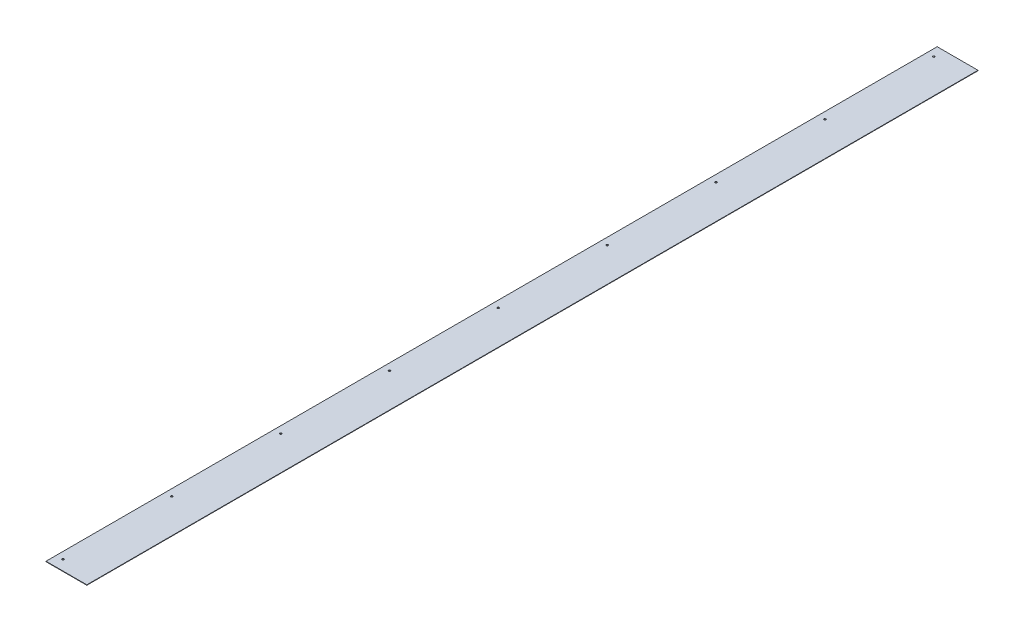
ISO-10303-21;
HEADER;
FILE_DESCRIPTION(('STEP AP214'),'2;1');
FILE_NAME('part.step','',(''),(''),'','','');
FILE_SCHEMA(('AUTOMOTIVE_DESIGN { 1 0 10303 214 1 1 1 1 }'));
ENDSEC;
DATA;
#1=APPLICATION_CONTEXT('core data for automotive mechanical design processes');
#2=APPLICATION_PROTOCOL_DEFINITION('international standard','automotive_design',2000,#1);
#3=PRODUCT_CONTEXT('',#1,'mechanical');
#4=PRODUCT('Part','Part','',(#3));
#5=PRODUCT_RELATED_PRODUCT_CATEGORY('part','',(#4));
#6=PRODUCT_DEFINITION_FORMATION('','',#4);
#7=PRODUCT_DEFINITION_CONTEXT('part definition',#1,'design');
#8=PRODUCT_DEFINITION('design','',#6,#7);
#9=PRODUCT_DEFINITION_SHAPE('','',#8);
#10=(LENGTH_UNIT() NAMED_UNIT(*) SI_UNIT(.MILLI.,.METRE.));
#11=(NAMED_UNIT(*) PLANE_ANGLE_UNIT() SI_UNIT($,.RADIAN.));
#12=(NAMED_UNIT(*) SI_UNIT($,.STERADIAN.) SOLID_ANGLE_UNIT());
#13=UNCERTAINTY_MEASURE_WITH_UNIT(LENGTH_MEASURE(1.E-05),#10,'distance_accuracy_value','');
#14=(GEOMETRIC_REPRESENTATION_CONTEXT(3) GLOBAL_UNCERTAINTY_ASSIGNED_CONTEXT((#13)) GLOBAL_UNIT_ASSIGNED_CONTEXT((#10,
#11,#12)) REPRESENTATION_CONTEXT('',''));
#15=CARTESIAN_POINT('',(0.,0.,0.));
#16=DIRECTION('',(0.,0.,1.));
#17=DIRECTION('',(1.,0.,0.));
#18=AXIS2_PLACEMENT_3D('',#15,#16,#17);
#19=CARTESIAN_POINT('',(-38.1,-0.396875,-831.85));
#20=DIRECTION('',(0.,-1.,0.));
#21=DIRECTION('',(0.,0.,-1.));
#22=AXIS2_PLACEMENT_3D('',#19,#20,#21);
#23=PLANE('',#22);
#24=DIRECTION('',(0.,0.,-1.));
#25=VECTOR('',#24,1.);
#26=CARTESIAN_POINT('',(38.1,-0.396875,831.85));
#27=LINE('',#26,#25);
#28=CARTESIAN_POINT('',(38.1,-0.396875,831.85));
#29=VERTEX_POINT('',#28);
#30=CARTESIAN_POINT('',(38.1,-0.396875,-831.85));
#31=VERTEX_POINT('',#30);
#32=EDGE_CURVE('E379',#29,#31,#27,.T.);
#33=ORIENTED_EDGE('',*,*,#32,.F.);
#34=DIRECTION('',(1.,0.,0.));
#35=VECTOR('',#34,1.);
#36=CARTESIAN_POINT('',(-38.1,-0.396875,831.85));
#37=LINE('',#36,#35);
#38=CARTESIAN_POINT('',(-38.1,-0.396875,831.85));
#39=VERTEX_POINT('',#38);
#40=EDGE_CURVE('E384',#39,#29,#37,.T.);
#41=ORIENTED_EDGE('',*,*,#40,.F.);
#42=DIRECTION('',(0.,0.,1.));
#43=VECTOR('',#42,1.);
#44=CARTESIAN_POINT('',(-38.1,-0.396875,-831.85));
#45=LINE('',#44,#43);
#46=CARTESIAN_POINT('',(-38.1,-0.396875,-831.85));
#47=VERTEX_POINT('',#46);
#48=EDGE_CURVE('E388',#47,#39,#45,.T.);
#49=ORIENTED_EDGE('',*,*,#48,.F.);
#50=DIRECTION('',(-1.,0.,0.));
#51=VECTOR('',#50,1.);
#52=CARTESIAN_POINT('',(38.1,-0.396875,-831.85));
#53=LINE('',#52,#51);
#54=EDGE_CURVE('E393',#31,#47,#53,.T.);
#55=ORIENTED_EDGE('',*,*,#54,.F.);
#56=EDGE_LOOP('',(#33,#41,#49,#55));
#57=FACE_BOUND('',#56,.T.);
#58=CARTESIAN_POINT('',(-25.4,-0.396875,812.8));
#59=DIRECTION('',(0.,-1.,0.));
#60=DIRECTION('',(0.,0.,-1.));
#61=AXIS2_PLACEMENT_3D('',#58,#59,#60);
#62=CIRCLE('',#61,1.778);
#63=CARTESIAN_POINT('',(-27.178,-0.396875,812.8));
#64=VERTEX_POINT('',#63);
#65=CARTESIAN_POINT('',(-23.622,-0.396875,812.8));
#66=VERTEX_POINT('',#65);
#67=EDGE_CURVE('E271',#64,#66,#62,.F.);
#68=ORIENTED_EDGE('',*,*,#67,.T.);
#69=CARTESIAN_POINT('',(-25.4,-0.396875,812.8));
#70=DIRECTION('',(0.,-1.,0.));
#71=DIRECTION('',(0.,0.,-1.));
#72=AXIS2_PLACEMENT_3D('',#69,#70,#71);
#73=CIRCLE('',#72,1.778);
#74=EDGE_CURVE('E267',#66,#64,#73,.F.);
#75=ORIENTED_EDGE('',*,*,#74,.T.);
#76=EDGE_LOOP('',(#68,#75));
#77=FACE_BOUND('',#76,.T.);
#78=CARTESIAN_POINT('',(-25.4,-0.396875,609.6));
#79=DIRECTION('',(0.,-1.,0.));
#80=DIRECTION('',(0.,0.,-1.));
#81=AXIS2_PLACEMENT_3D('',#78,#79,#80);
#82=CIRCLE('',#81,1.778);
#83=CARTESIAN_POINT('',(-27.178,-0.396875,609.6));
#84=VERTEX_POINT('',#83);
#85=CARTESIAN_POINT('',(-23.622,-0.396875,609.6));
#86=VERTEX_POINT('',#85);
#87=EDGE_CURVE('E279',#84,#86,#82,.F.);
#88=ORIENTED_EDGE('',*,*,#87,.T.);
#89=CARTESIAN_POINT('',(-25.4,-0.396875,609.6));
#90=DIRECTION('',(0.,-1.,0.));
#91=DIRECTION('',(0.,0.,-1.));
#92=AXIS2_PLACEMENT_3D('',#89,#90,#91);
#93=CIRCLE('',#92,1.778);
#94=EDGE_CURVE('E275',#86,#84,#93,.F.);
#95=ORIENTED_EDGE('',*,*,#94,.T.);
#96=EDGE_LOOP('',(#88,#95));
#97=FACE_BOUND('',#96,.T.);
#98=CARTESIAN_POINT('',(-25.4,-0.396875,406.4));
#99=DIRECTION('',(0.,-1.,0.));
#100=DIRECTION('',(0.,0.,-1.));
#101=AXIS2_PLACEMENT_3D('',#98,#99,#100);
#102=CIRCLE('',#101,1.778);
#103=CARTESIAN_POINT('',(-27.178,-0.396875,406.4));
#104=VERTEX_POINT('',#103);
#105=CARTESIAN_POINT('',(-23.622,-0.396875,406.4));
#106=VERTEX_POINT('',#105);
#107=EDGE_CURVE('E288',#104,#106,#102,.F.);
#108=ORIENTED_EDGE('',*,*,#107,.T.);
#109=CARTESIAN_POINT('',(-25.4,-0.396875,406.4));
#110=DIRECTION('',(0.,-1.,0.));
#111=DIRECTION('',(0.,0.,-1.));
#112=AXIS2_PLACEMENT_3D('',#109,#110,#111);
#113=CIRCLE('',#112,1.778);
#114=EDGE_CURVE('E283',#106,#104,#113,.F.);
#115=ORIENTED_EDGE('',*,*,#114,.T.);
#116=EDGE_LOOP('',(#108,#115));
#117=FACE_BOUND('',#116,.T.);
#118=CARTESIAN_POINT('',(-25.4,-0.396875,203.2));
#119=DIRECTION('',(0.,-1.,0.));
#120=DIRECTION('',(0.,0.,-1.));
#121=AXIS2_PLACEMENT_3D('',#118,#119,#120);
#122=CIRCLE('',#121,1.778);
#123=CARTESIAN_POINT('',(-27.178,-0.396875,203.2));
#124=VERTEX_POINT('',#123);
#125=CARTESIAN_POINT('',(-23.622,-0.396875,203.2));
#126=VERTEX_POINT('',#125);
#127=EDGE_CURVE('E298',#124,#126,#122,.F.);
#128=ORIENTED_EDGE('',*,*,#127,.T.);
#129=CARTESIAN_POINT('',(-25.4,-0.396875,203.2));
#130=DIRECTION('',(0.,-1.,0.));
#131=DIRECTION('',(0.,0.,-1.));
#132=AXIS2_PLACEMENT_3D('',#129,#130,#131);
#133=CIRCLE('',#132,1.778);
#134=EDGE_CURVE('E293',#126,#124,#133,.F.);
#135=ORIENTED_EDGE('',*,*,#134,.T.);
#136=EDGE_LOOP('',(#128,#135));
#137=FACE_BOUND('',#136,.T.);
#138=CARTESIAN_POINT('',(-25.4,-0.396875,0.));
#139=DIRECTION('',(0.,-1.,0.));
#140=DIRECTION('',(0.,0.,-1.));
#141=AXIS2_PLACEMENT_3D('',#138,#139,#140);
#142=CIRCLE('',#141,1.778);
#143=CARTESIAN_POINT('',(-27.178,-0.396875,0.));
#144=VERTEX_POINT('',#143);
#145=CARTESIAN_POINT('',(-23.622,-0.396875,0.));
#146=VERTEX_POINT('',#145);
#147=EDGE_CURVE('E308',#144,#146,#142,.F.);
#148=ORIENTED_EDGE('',*,*,#147,.T.);
#149=CARTESIAN_POINT('',(-25.4,-0.396875,0.));
#150=DIRECTION('',(0.,-1.,0.));
#151=DIRECTION('',(0.,0.,-1.));
#152=AXIS2_PLACEMENT_3D('',#149,#150,#151);
#153=CIRCLE('',#152,1.778);
#154=EDGE_CURVE('E303',#146,#144,#153,.F.);
#155=ORIENTED_EDGE('',*,*,#154,.T.);
#156=EDGE_LOOP('',(#148,#155));
#157=FACE_BOUND('',#156,.T.);
#158=CARTESIAN_POINT('',(-25.4,-0.396875,-203.2));
#159=DIRECTION('',(0.,-1.,0.));
#160=DIRECTION('',(0.,0.,-1.));
#161=AXIS2_PLACEMENT_3D('',#158,#159,#160);
#162=CIRCLE('',#161,1.778);
#163=CARTESIAN_POINT('',(-27.178,-0.396875,-203.2));
#164=VERTEX_POINT('',#163);
#165=CARTESIAN_POINT('',(-23.622,-0.396875,-203.2));
#166=VERTEX_POINT('',#165);
#167=EDGE_CURVE('E318',#164,#166,#162,.F.);
#168=ORIENTED_EDGE('',*,*,#167,.T.);
#169=CARTESIAN_POINT('',(-25.4,-0.396875,-203.2));
#170=DIRECTION('',(0.,-1.,0.));
#171=DIRECTION('',(0.,0.,-1.));
#172=AXIS2_PLACEMENT_3D('',#169,#170,#171);
#173=CIRCLE('',#172,1.778);
#174=EDGE_CURVE('E313',#166,#164,#173,.F.);
#175=ORIENTED_EDGE('',*,*,#174,.T.);
#176=EDGE_LOOP('',(#168,#175));
#177=FACE_BOUND('',#176,.T.);
#178=CARTESIAN_POINT('',(-25.4,-0.396875,-406.4));
#179=DIRECTION('',(0.,-1.,0.));
#180=DIRECTION('',(0.,0.,-1.));
#181=AXIS2_PLACEMENT_3D('',#178,#179,#180);
#182=CIRCLE('',#181,1.778);
#183=CARTESIAN_POINT('',(-27.178,-0.396875,-406.4));
#184=VERTEX_POINT('',#183);
#185=CARTESIAN_POINT('',(-23.622,-0.396875,-406.4));
#186=VERTEX_POINT('',#185);
#187=EDGE_CURVE('E328',#184,#186,#182,.F.);
#188=ORIENTED_EDGE('',*,*,#187,.T.);
#189=CARTESIAN_POINT('',(-25.4,-0.396875,-406.4));
#190=DIRECTION('',(0.,-1.,0.));
#191=DIRECTION('',(0.,0.,-1.));
#192=AXIS2_PLACEMENT_3D('',#189,#190,#191);
#193=CIRCLE('',#192,1.778);
#194=EDGE_CURVE('E323',#186,#184,#193,.F.);
#195=ORIENTED_EDGE('',*,*,#194,.T.);
#196=EDGE_LOOP('',(#188,#195));
#197=FACE_BOUND('',#196,.T.);
#198=CARTESIAN_POINT('',(-25.4,-0.396875,-609.6));
#199=DIRECTION('',(0.,-1.,0.));
#200=DIRECTION('',(0.,0.,-1.));
#201=AXIS2_PLACEMENT_3D('',#198,#199,#200);
#202=CIRCLE('',#201,1.778);
#203=CARTESIAN_POINT('',(-27.178,-0.396875,-609.6));
#204=VERTEX_POINT('',#203);
#205=CARTESIAN_POINT('',(-23.622,-0.396875,-609.6));
#206=VERTEX_POINT('',#205);
#207=EDGE_CURVE('E196',#204,#206,#202,.F.);
#208=ORIENTED_EDGE('',*,*,#207,.T.);
#209=CARTESIAN_POINT('',(-25.4,-0.396875,-609.6));
#210=DIRECTION('',(0.,-1.,0.));
#211=DIRECTION('',(0.,0.,-1.));
#212=AXIS2_PLACEMENT_3D('',#209,#210,#211);
#213=CIRCLE('',#212,1.778);
#214=EDGE_CURVE('E199',#206,#204,#213,.F.);
#215=ORIENTED_EDGE('',*,*,#214,.T.);
#216=EDGE_LOOP('',(#208,#215));
#217=FACE_BOUND('',#216,.T.);
#218=CARTESIAN_POINT('',(-25.4,-0.396875,-812.8));
#219=DIRECTION('',(0.,1.,0.));
#220=DIRECTION('',(0.,0.,1.));
#221=AXIS2_PLACEMENT_3D('',#218,#219,#220);
#222=CIRCLE('',#221,1.778);
#223=CARTESIAN_POINT('',(-27.178,-0.396875,-812.8));
#224=VERTEX_POINT('',#223);
#225=CARTESIAN_POINT('',(-23.622,-0.396875,-812.8));
#226=VERTEX_POINT('',#225);
#227=EDGE_CURVE('E19',#224,#226,#222,.T.);
#228=ORIENTED_EDGE('',*,*,#227,.T.);
#229=CARTESIAN_POINT('',(-25.4,-0.396875,-812.8));
#230=DIRECTION('',(0.,1.,0.));
#231=DIRECTION('',(0.,0.,1.));
#232=AXIS2_PLACEMENT_3D('',#229,#230,#231);
#233=CIRCLE('',#232,1.778);
#234=EDGE_CURVE('E186',#226,#224,#233,.T.);
#235=ORIENTED_EDGE('',*,*,#234,.T.);
#236=EDGE_LOOP('',(#228,#235));
#237=FACE_BOUND('',#236,.T.);
#238=ADVANCED_FACE('F16',(#57,#77,#97,#117,#137,#157,#177,#197,#217,#237),#23,.T.);
#239=CARTESIAN_POINT('',(-25.4,-0.396875,-812.8));
#240=DIRECTION('',(0.,1.,0.));
#241=DIRECTION('',(0.,0.,1.));
#242=AXIS2_PLACEMENT_3D('',#239,#240,#241);
#243=CYLINDRICAL_SURFACE('',#242,1.778);
#244=ORIENTED_EDGE('',*,*,#227,.F.);
#245=DIRECTION('',(0.,1.,0.));
#246=VECTOR('',#245,1.);
#247=CARTESIAN_POINT('',(-27.178,-0.396875,-812.8));
#248=LINE('',#247,#246);
#249=CARTESIAN_POINT('',(-27.178,0.396875,-812.8));
#250=VERTEX_POINT('',#249);
#251=EDGE_CURVE('E191',#224,#250,#248,.T.);
#252=ORIENTED_EDGE('',*,*,#251,.T.);
#253=CARTESIAN_POINT('',(-25.4,0.396875,-812.8));
#254=DIRECTION('',(0.,1.,0.));
#255=DIRECTION('',(0.,0.,1.));
#256=AXIS2_PLACEMENT_3D('',#253,#254,#255);
#257=CIRCLE('',#256,1.778);
#258=CARTESIAN_POINT('',(-23.622,0.396875,-812.8));
#259=VERTEX_POINT('',#258);
#260=EDGE_CURVE('E195',#250,#259,#257,.T.);
#261=ORIENTED_EDGE('',*,*,#260,.T.);
#262=DIRECTION('',(0.,1.,0.));
#263=VECTOR('',#262,1.);
#264=CARTESIAN_POINT('',(-23.622,-0.396875,-812.8));
#265=LINE('',#264,#263);
#266=EDGE_CURVE('E189',#259,#226,#265,.F.);
#267=ORIENTED_EDGE('',*,*,#266,.T.);
#268=EDGE_LOOP('',(#244,#252,#261,#267));
#269=FACE_BOUND('',#268,.T.);
#270=ADVANCED_FACE('F194',(#269),#243,.F.);
#271=CARTESIAN_POINT('',(-25.4,-0.396875,-812.8));
#272=DIRECTION('',(0.,1.,0.));
#273=DIRECTION('',(0.,0.,1.));
#274=AXIS2_PLACEMENT_3D('',#271,#272,#273);
#275=CYLINDRICAL_SURFACE('',#274,1.778);
#276=CARTESIAN_POINT('',(-25.4,0.396875,-812.8));
#277=DIRECTION('',(0.,1.,0.));
#278=DIRECTION('',(0.,0.,1.));
#279=AXIS2_PLACEMENT_3D('',#276,#277,#278);
#280=CIRCLE('',#279,1.778);
#281=EDGE_CURVE('E263',#259,#250,#280,.T.);
#282=ORIENTED_EDGE('',*,*,#281,.T.);
#283=ORIENTED_EDGE('',*,*,#251,.F.);
#284=ORIENTED_EDGE('',*,*,#234,.F.);
#285=ORIENTED_EDGE('',*,*,#266,.F.);
#286=EDGE_LOOP('',(#282,#283,#284,#285));
#287=FACE_BOUND('',#286,.T.);
#288=ADVANCED_FACE('F188',(#287),#275,.F.);
#289=CARTESIAN_POINT('',(-25.4,-0.396875,-609.6));
#290=DIRECTION('',(0.,-1.,0.));
#291=DIRECTION('',(0.,0.,-1.));
#292=AXIS2_PLACEMENT_3D('',#289,#290,#291);
#293=CYLINDRICAL_SURFACE('',#292,1.778);
#294=ORIENTED_EDGE('',*,*,#207,.F.);
#295=DIRECTION('',(0.,-1.,0.));
#296=VECTOR('',#295,1.);
#297=CARTESIAN_POINT('',(-27.178,-0.396875,-609.6));
#298=LINE('',#297,#296);
#299=CARTESIAN_POINT('',(-27.178,0.396875,-609.6));
#300=VERTEX_POINT('',#299);
#301=EDGE_CURVE('E334',#204,#300,#298,.F.);
#302=ORIENTED_EDGE('',*,*,#301,.T.);
#303=CARTESIAN_POINT('',(-25.4,0.396875,-609.6));
#304=DIRECTION('',(0.,-1.,0.));
#305=DIRECTION('',(0.,0.,-1.));
#306=AXIS2_PLACEMENT_3D('',#303,#304,#305);
#307=CIRCLE('',#306,1.778);
#308=CARTESIAN_POINT('',(-23.622,0.396875,-609.6));
#309=VERTEX_POINT('',#308);
#310=EDGE_CURVE('E260',#300,#309,#307,.F.);
#311=ORIENTED_EDGE('',*,*,#310,.T.);
#312=DIRECTION('',(0.,-1.,0.));
#313=VECTOR('',#312,1.);
#314=CARTESIAN_POINT('',(-23.622,-0.396875,-609.6));
#315=LINE('',#314,#313);
#316=EDGE_CURVE('E332',#309,#206,#315,.T.);
#317=ORIENTED_EDGE('',*,*,#316,.T.);
#318=EDGE_LOOP('',(#294,#302,#311,#317));
#319=FACE_BOUND('',#318,.T.);
#320=ADVANCED_FACE('F498',(#319),#293,.F.);
#321=CARTESIAN_POINT('',(-25.4,-0.396875,-609.6));
#322=DIRECTION('',(0.,-1.,0.));
#323=DIRECTION('',(0.,0.,-1.));
#324=AXIS2_PLACEMENT_3D('',#321,#322,#323);
#325=CYLINDRICAL_SURFACE('',#324,1.778);
#326=CARTESIAN_POINT('',(-25.4,0.396875,-609.6));
#327=DIRECTION('',(0.,-1.,0.));
#328=DIRECTION('',(0.,0.,-1.));
#329=AXIS2_PLACEMENT_3D('',#326,#327,#328);
#330=CIRCLE('',#329,1.778);
#331=EDGE_CURVE('E257',#309,#300,#330,.F.);
#332=ORIENTED_EDGE('',*,*,#331,.T.);
#333=ORIENTED_EDGE('',*,*,#301,.F.);
#334=ORIENTED_EDGE('',*,*,#214,.F.);
#335=ORIENTED_EDGE('',*,*,#316,.F.);
#336=EDGE_LOOP('',(#332,#333,#334,#335));
#337=FACE_BOUND('',#336,.T.);
#338=ADVANCED_FACE('F494',(#337),#325,.F.);
#339=CARTESIAN_POINT('',(-25.4,-0.396875,-406.4));
#340=DIRECTION('',(0.,-1.,0.));
#341=DIRECTION('',(0.,0.,-1.));
#342=AXIS2_PLACEMENT_3D('',#339,#340,#341);
#343=CYLINDRICAL_SURFACE('',#342,1.778);
#344=ORIENTED_EDGE('',*,*,#187,.F.);
#345=DIRECTION('',(0.,-1.,0.));
#346=VECTOR('',#345,1.);
#347=CARTESIAN_POINT('',(-27.178,-0.396875,-406.4));
#348=LINE('',#347,#346);
#349=CARTESIAN_POINT('',(-27.178,0.396875,-406.4));
#350=VERTEX_POINT('',#349);
#351=EDGE_CURVE('E327',#184,#350,#348,.F.);
#352=ORIENTED_EDGE('',*,*,#351,.T.);
#353=CARTESIAN_POINT('',(-25.4,0.396875,-406.4));
#354=DIRECTION('',(0.,-1.,0.));
#355=DIRECTION('',(0.,0.,-1.));
#356=AXIS2_PLACEMENT_3D('',#353,#354,#355);
#357=CIRCLE('',#356,1.778);
#358=CARTESIAN_POINT('',(-23.622,0.396875,-406.4));
#359=VERTEX_POINT('',#358);
#360=EDGE_CURVE('E253',#350,#359,#357,.F.);
#361=ORIENTED_EDGE('',*,*,#360,.T.);
#362=DIRECTION('',(0.,-1.,0.));
#363=VECTOR('',#362,1.);
#364=CARTESIAN_POINT('',(-23.622,-0.396875,-406.4));
#365=LINE('',#364,#363);
#366=EDGE_CURVE('E322',#359,#186,#365,.T.);
#367=ORIENTED_EDGE('',*,*,#366,.T.);
#368=EDGE_LOOP('',(#344,#352,#361,#367));
#369=FACE_BOUND('',#368,.T.);
#370=ADVANCED_FACE('F490',(#369),#343,.F.);
#371=CARTESIAN_POINT('',(-25.4,-0.396875,-406.4));
#372=DIRECTION('',(0.,-1.,0.));
#373=DIRECTION('',(0.,0.,-1.));
#374=AXIS2_PLACEMENT_3D('',#371,#372,#373);
#375=CYLINDRICAL_SURFACE('',#374,1.778);
#376=CARTESIAN_POINT('',(-25.4,0.396875,-406.4));
#377=DIRECTION('',(0.,-1.,0.));
#378=DIRECTION('',(0.,0.,-1.));
#379=AXIS2_PLACEMENT_3D('',#376,#377,#378);
#380=CIRCLE('',#379,1.778);
#381=EDGE_CURVE('E249',#359,#350,#380,.F.);
#382=ORIENTED_EDGE('',*,*,#381,.T.);
#383=ORIENTED_EDGE('',*,*,#351,.F.);
#384=ORIENTED_EDGE('',*,*,#194,.F.);
#385=ORIENTED_EDGE('',*,*,#366,.F.);
#386=EDGE_LOOP('',(#382,#383,#384,#385));
#387=FACE_BOUND('',#386,.T.);
#388=ADVANCED_FACE('F486',(#387),#375,.F.);
#389=CARTESIAN_POINT('',(-25.4,-0.396875,-203.2));
#390=DIRECTION('',(0.,-1.,0.));
#391=DIRECTION('',(0.,0.,-1.));
#392=AXIS2_PLACEMENT_3D('',#389,#390,#391);
#393=CYLINDRICAL_SURFACE('',#392,1.778);
#394=ORIENTED_EDGE('',*,*,#167,.F.);
#395=DIRECTION('',(0.,-1.,0.));
#396=VECTOR('',#395,1.);
#397=CARTESIAN_POINT('',(-27.178,-0.396875,-203.2));
#398=LINE('',#397,#396);
#399=CARTESIAN_POINT('',(-27.178,0.396875,-203.2));
#400=VERTEX_POINT('',#399);
#401=EDGE_CURVE('E317',#164,#400,#398,.F.);
#402=ORIENTED_EDGE('',*,*,#401,.T.);
#403=CARTESIAN_POINT('',(-25.4,0.396875,-203.2));
#404=DIRECTION('',(0.,-1.,0.));
#405=DIRECTION('',(0.,0.,-1.));
#406=AXIS2_PLACEMENT_3D('',#403,#404,#405);
#407=CIRCLE('',#406,1.778);
#408=CARTESIAN_POINT('',(-23.622,0.396875,-203.2));
#409=VERTEX_POINT('',#408);
#410=EDGE_CURVE('E245',#400,#409,#407,.F.);
#411=ORIENTED_EDGE('',*,*,#410,.T.);
#412=DIRECTION('',(0.,-1.,0.));
#413=VECTOR('',#412,1.);
#414=CARTESIAN_POINT('',(-23.622,-0.396875,-203.2));
#415=LINE('',#414,#413);
#416=EDGE_CURVE('E312',#409,#166,#415,.T.);
#417=ORIENTED_EDGE('',*,*,#416,.T.);
#418=EDGE_LOOP('',(#394,#402,#411,#417));
#419=FACE_BOUND('',#418,.T.);
#420=ADVANCED_FACE('F482',(#419),#393,.F.);
#421=CARTESIAN_POINT('',(-25.4,-0.396875,-203.2));
#422=DIRECTION('',(0.,-1.,0.));
#423=DIRECTION('',(0.,0.,-1.));
#424=AXIS2_PLACEMENT_3D('',#421,#422,#423);
#425=CYLINDRICAL_SURFACE('',#424,1.778);
#426=CARTESIAN_POINT('',(-25.4,0.396875,-203.2));
#427=DIRECTION('',(0.,-1.,0.));
#428=DIRECTION('',(0.,0.,-1.));
#429=AXIS2_PLACEMENT_3D('',#426,#427,#428);
#430=CIRCLE('',#429,1.778);
#431=EDGE_CURVE('E241',#409,#400,#430,.F.);
#432=ORIENTED_EDGE('',*,*,#431,.T.);
#433=ORIENTED_EDGE('',*,*,#401,.F.);
#434=ORIENTED_EDGE('',*,*,#174,.F.);
#435=ORIENTED_EDGE('',*,*,#416,.F.);
#436=EDGE_LOOP('',(#432,#433,#434,#435));
#437=FACE_BOUND('',#436,.T.);
#438=ADVANCED_FACE('F478',(#437),#425,.F.);
#439=CARTESIAN_POINT('',(-25.4,-0.396875,0.));
#440=DIRECTION('',(0.,-1.,0.));
#441=DIRECTION('',(0.,0.,-1.));
#442=AXIS2_PLACEMENT_3D('',#439,#440,#441);
#443=CYLINDRICAL_SURFACE('',#442,1.778);
#444=ORIENTED_EDGE('',*,*,#147,.F.);
#445=DIRECTION('',(0.,-1.,0.));
#446=VECTOR('',#445,1.);
#447=CARTESIAN_POINT('',(-27.178,-0.396875,0.));
#448=LINE('',#447,#446);
#449=CARTESIAN_POINT('',(-27.178,0.396875,0.));
#450=VERTEX_POINT('',#449);
#451=EDGE_CURVE('E307',#144,#450,#448,.F.);
#452=ORIENTED_EDGE('',*,*,#451,.T.);
#453=CARTESIAN_POINT('',(-25.4,0.396875,0.));
#454=DIRECTION('',(0.,-1.,0.));
#455=DIRECTION('',(0.,0.,-1.));
#456=AXIS2_PLACEMENT_3D('',#453,#454,#455);
#457=CIRCLE('',#456,1.778);
#458=CARTESIAN_POINT('',(-23.622,0.396875,0.));
#459=VERTEX_POINT('',#458);
#460=EDGE_CURVE('E237',#450,#459,#457,.F.);
#461=ORIENTED_EDGE('',*,*,#460,.T.);
#462=DIRECTION('',(0.,-1.,0.));
#463=VECTOR('',#462,1.);
#464=CARTESIAN_POINT('',(-23.622,-0.396875,0.));
#465=LINE('',#464,#463);
#466=EDGE_CURVE('E302',#459,#146,#465,.T.);
#467=ORIENTED_EDGE('',*,*,#466,.T.);
#468=EDGE_LOOP('',(#444,#452,#461,#467));
#469=FACE_BOUND('',#468,.T.);
#470=ADVANCED_FACE('F474',(#469),#443,.F.);
#471=CARTESIAN_POINT('',(-25.4,-0.396875,0.));
#472=DIRECTION('',(0.,-1.,0.));
#473=DIRECTION('',(0.,0.,-1.));
#474=AXIS2_PLACEMENT_3D('',#471,#472,#473);
#475=CYLINDRICAL_SURFACE('',#474,1.778);
#476=CARTESIAN_POINT('',(-25.4,0.396875,0.));
#477=DIRECTION('',(0.,-1.,0.));
#478=DIRECTION('',(0.,0.,-1.));
#479=AXIS2_PLACEMENT_3D('',#476,#477,#478);
#480=CIRCLE('',#479,1.778);
#481=EDGE_CURVE('E233',#459,#450,#480,.F.);
#482=ORIENTED_EDGE('',*,*,#481,.T.);
#483=ORIENTED_EDGE('',*,*,#451,.F.);
#484=ORIENTED_EDGE('',*,*,#154,.F.);
#485=ORIENTED_EDGE('',*,*,#466,.F.);
#486=EDGE_LOOP('',(#482,#483,#484,#485));
#487=FACE_BOUND('',#486,.T.);
#488=ADVANCED_FACE('F470',(#487),#475,.F.);
#489=CARTESIAN_POINT('',(-25.4,-0.396875,203.2));
#490=DIRECTION('',(0.,-1.,0.));
#491=DIRECTION('',(0.,0.,-1.));
#492=AXIS2_PLACEMENT_3D('',#489,#490,#491);
#493=CYLINDRICAL_SURFACE('',#492,1.778);
#494=ORIENTED_EDGE('',*,*,#127,.F.);
#495=DIRECTION('',(0.,-1.,0.));
#496=VECTOR('',#495,1.);
#497=CARTESIAN_POINT('',(-27.178,-0.396875,203.2));
#498=LINE('',#497,#496);
#499=CARTESIAN_POINT('',(-27.178,0.396875,203.2));
#500=VERTEX_POINT('',#499);
#501=EDGE_CURVE('E297',#124,#500,#498,.F.);
#502=ORIENTED_EDGE('',*,*,#501,.T.);
#503=CARTESIAN_POINT('',(-25.4,0.396875,203.2));
#504=DIRECTION('',(0.,-1.,0.));
#505=DIRECTION('',(0.,0.,-1.));
#506=AXIS2_PLACEMENT_3D('',#503,#504,#505);
#507=CIRCLE('',#506,1.778);
#508=CARTESIAN_POINT('',(-23.622,0.396875,203.2));
#509=VERTEX_POINT('',#508);
#510=EDGE_CURVE('E229',#500,#509,#507,.F.);
#511=ORIENTED_EDGE('',*,*,#510,.T.);
#512=DIRECTION('',(0.,-1.,0.));
#513=VECTOR('',#512,1.);
#514=CARTESIAN_POINT('',(-23.622,-0.396875,203.2));
#515=LINE('',#514,#513);
#516=EDGE_CURVE('E292',#509,#126,#515,.T.);
#517=ORIENTED_EDGE('',*,*,#516,.T.);
#518=EDGE_LOOP('',(#494,#502,#511,#517));
#519=FACE_BOUND('',#518,.T.);
#520=ADVANCED_FACE('F466',(#519),#493,.F.);
#521=CARTESIAN_POINT('',(-25.4,-0.396875,203.2));
#522=DIRECTION('',(0.,-1.,0.));
#523=DIRECTION('',(0.,0.,-1.));
#524=AXIS2_PLACEMENT_3D('',#521,#522,#523);
#525=CYLINDRICAL_SURFACE('',#524,1.778);
#526=CARTESIAN_POINT('',(-25.4,0.396875,203.2));
#527=DIRECTION('',(0.,-1.,0.));
#528=DIRECTION('',(0.,0.,-1.));
#529=AXIS2_PLACEMENT_3D('',#526,#527,#528);
#530=CIRCLE('',#529,1.778);
#531=EDGE_CURVE('E225',#509,#500,#530,.F.);
#532=ORIENTED_EDGE('',*,*,#531,.T.);
#533=ORIENTED_EDGE('',*,*,#501,.F.);
#534=ORIENTED_EDGE('',*,*,#134,.F.);
#535=ORIENTED_EDGE('',*,*,#516,.F.);
#536=EDGE_LOOP('',(#532,#533,#534,#535));
#537=FACE_BOUND('',#536,.T.);
#538=ADVANCED_FACE('F462',(#537),#525,.F.);
#539=CARTESIAN_POINT('',(-25.4,-0.396875,406.4));
#540=DIRECTION('',(0.,-1.,0.));
#541=DIRECTION('',(0.,0.,-1.));
#542=AXIS2_PLACEMENT_3D('',#539,#540,#541);
#543=CYLINDRICAL_SURFACE('',#542,1.778);
#544=ORIENTED_EDGE('',*,*,#107,.F.);
#545=DIRECTION('',(0.,-1.,0.));
#546=VECTOR('',#545,1.);
#547=CARTESIAN_POINT('',(-27.178,-0.396875,406.4));
#548=LINE('',#547,#546);
#549=CARTESIAN_POINT('',(-27.178,0.396875,406.4));
#550=VERTEX_POINT('',#549);
#551=EDGE_CURVE('E287',#104,#550,#548,.F.);
#552=ORIENTED_EDGE('',*,*,#551,.T.);
#553=CARTESIAN_POINT('',(-25.4,0.396875,406.4));
#554=DIRECTION('',(0.,-1.,0.));
#555=DIRECTION('',(0.,0.,-1.));
#556=AXIS2_PLACEMENT_3D('',#553,#554,#555);
#557=CIRCLE('',#556,1.778);
#558=CARTESIAN_POINT('',(-23.622,0.396875,406.4));
#559=VERTEX_POINT('',#558);
#560=EDGE_CURVE('E221',#550,#559,#557,.F.);
#561=ORIENTED_EDGE('',*,*,#560,.T.);
#562=DIRECTION('',(0.,-1.,0.));
#563=VECTOR('',#562,1.);
#564=CARTESIAN_POINT('',(-23.622,-0.396875,406.4));
#565=LINE('',#564,#563);
#566=EDGE_CURVE('E282',#559,#106,#565,.T.);
#567=ORIENTED_EDGE('',*,*,#566,.T.);
#568=EDGE_LOOP('',(#544,#552,#561,#567));
#569=FACE_BOUND('',#568,.T.);
#570=ADVANCED_FACE('F458',(#569),#543,.F.);
#571=CARTESIAN_POINT('',(-25.4,-0.396875,406.4));
#572=DIRECTION('',(0.,-1.,0.));
#573=DIRECTION('',(0.,0.,-1.));
#574=AXIS2_PLACEMENT_3D('',#571,#572,#573);
#575=CYLINDRICAL_SURFACE('',#574,1.778);
#576=CARTESIAN_POINT('',(-25.4,0.396875,406.4));
#577=DIRECTION('',(0.,-1.,0.));
#578=DIRECTION('',(0.,0.,-1.));
#579=AXIS2_PLACEMENT_3D('',#576,#577,#578);
#580=CIRCLE('',#579,1.778);
#581=EDGE_CURVE('E217',#559,#550,#580,.F.);
#582=ORIENTED_EDGE('',*,*,#581,.T.);
#583=ORIENTED_EDGE('',*,*,#551,.F.);
#584=ORIENTED_EDGE('',*,*,#114,.F.);
#585=ORIENTED_EDGE('',*,*,#566,.F.);
#586=EDGE_LOOP('',(#582,#583,#584,#585));
#587=FACE_BOUND('',#586,.T.);
#588=ADVANCED_FACE('F454',(#587),#575,.F.);
#589=CARTESIAN_POINT('',(-25.4,-0.396875,609.6));
#590=DIRECTION('',(0.,-1.,0.));
#591=DIRECTION('',(0.,0.,-1.));
#592=AXIS2_PLACEMENT_3D('',#589,#590,#591);
#593=CYLINDRICAL_SURFACE('',#592,1.778);
#594=ORIENTED_EDGE('',*,*,#87,.F.);
#595=DIRECTION('',(0.,-1.,0.));
#596=VECTOR('',#595,1.);
#597=CARTESIAN_POINT('',(-27.178,-0.396875,609.6));
#598=LINE('',#597,#596);
#599=CARTESIAN_POINT('',(-27.178,0.396875,609.6));
#600=VERTEX_POINT('',#599);
#601=EDGE_CURVE('E278',#84,#600,#598,.F.);
#602=ORIENTED_EDGE('',*,*,#601,.T.);
#603=CARTESIAN_POINT('',(-25.4,0.396875,609.6));
#604=DIRECTION('',(0.,-1.,0.));
#605=DIRECTION('',(0.,0.,-1.));
#606=AXIS2_PLACEMENT_3D('',#603,#604,#605);
#607=CIRCLE('',#606,1.778);
#608=CARTESIAN_POINT('',(-23.622,0.396875,609.6));
#609=VERTEX_POINT('',#608);
#610=EDGE_CURVE('E214',#600,#609,#607,.F.);
#611=ORIENTED_EDGE('',*,*,#610,.T.);
#612=DIRECTION('',(0.,-1.,0.));
#613=VECTOR('',#612,1.);
#614=CARTESIAN_POINT('',(-23.622,-0.396875,609.6));
#615=LINE('',#614,#613);
#616=EDGE_CURVE('E274',#609,#86,#615,.T.);
#617=ORIENTED_EDGE('',*,*,#616,.T.);
#618=EDGE_LOOP('',(#594,#602,#611,#617));
#619=FACE_BOUND('',#618,.T.);
#620=ADVANCED_FACE('F450',(#619),#593,.F.);
#621=CARTESIAN_POINT('',(-25.4,-0.396875,609.6));
#622=DIRECTION('',(0.,-1.,0.));
#623=DIRECTION('',(0.,0.,-1.));
#624=AXIS2_PLACEMENT_3D('',#621,#622,#623);
#625=CYLINDRICAL_SURFACE('',#624,1.778);
#626=CARTESIAN_POINT('',(-25.4,0.396875,609.6));
#627=DIRECTION('',(0.,-1.,0.));
#628=DIRECTION('',(0.,0.,-1.));
#629=AXIS2_PLACEMENT_3D('',#626,#627,#628);
#630=CIRCLE('',#629,1.778);
#631=EDGE_CURVE('E211',#609,#600,#630,.F.);
#632=ORIENTED_EDGE('',*,*,#631,.T.);
#633=ORIENTED_EDGE('',*,*,#601,.F.);
#634=ORIENTED_EDGE('',*,*,#94,.F.);
#635=ORIENTED_EDGE('',*,*,#616,.F.);
#636=EDGE_LOOP('',(#632,#633,#634,#635));
#637=FACE_BOUND('',#636,.T.);
#638=ADVANCED_FACE('F446',(#637),#625,.F.);
#639=CARTESIAN_POINT('',(-25.4,-0.396875,812.8));
#640=DIRECTION('',(0.,-1.,0.));
#641=DIRECTION('',(0.,0.,-1.));
#642=AXIS2_PLACEMENT_3D('',#639,#640,#641);
#643=CYLINDRICAL_SURFACE('',#642,1.778);
#644=ORIENTED_EDGE('',*,*,#67,.F.);
#645=DIRECTION('',(0.,-1.,0.));
#646=VECTOR('',#645,1.);
#647=CARTESIAN_POINT('',(-27.178,-0.396875,812.8));
#648=LINE('',#647,#646);
#649=CARTESIAN_POINT('',(-27.178,0.396875,812.8));
#650=VERTEX_POINT('',#649);
#651=EDGE_CURVE('E270',#64,#650,#648,.F.);
#652=ORIENTED_EDGE('',*,*,#651,.T.);
#653=CARTESIAN_POINT('',(-25.4,0.396875,812.8));
#654=DIRECTION('',(0.,-1.,0.));
#655=DIRECTION('',(0.,0.,-1.));
#656=AXIS2_PLACEMENT_3D('',#653,#654,#655);
#657=CIRCLE('',#656,1.778);
#658=CARTESIAN_POINT('',(-23.622,0.396875,812.8));
#659=VERTEX_POINT('',#658);
#660=EDGE_CURVE('E208',#650,#659,#657,.F.);
#661=ORIENTED_EDGE('',*,*,#660,.T.);
#662=DIRECTION('',(0.,-1.,0.));
#663=VECTOR('',#662,1.);
#664=CARTESIAN_POINT('',(-23.622,-0.396875,812.8));
#665=LINE('',#664,#663);
#666=EDGE_CURVE('E376',#659,#66,#665,.T.);
#667=ORIENTED_EDGE('',*,*,#666,.T.);
#668=EDGE_LOOP('',(#644,#652,#661,#667));
#669=FACE_BOUND('',#668,.T.);
#670=ADVANCED_FACE('F442',(#669),#643,.F.);
#671=CARTESIAN_POINT('',(-25.4,-0.396875,812.8));
#672=DIRECTION('',(0.,-1.,0.));
#673=DIRECTION('',(0.,0.,-1.));
#674=AXIS2_PLACEMENT_3D('',#671,#672,#673);
#675=CYLINDRICAL_SURFACE('',#674,1.778);
#676=CARTESIAN_POINT('',(-25.4,0.396875,812.8));
#677=DIRECTION('',(0.,-1.,0.));
#678=DIRECTION('',(0.,0.,-1.));
#679=AXIS2_PLACEMENT_3D('',#676,#677,#678);
#680=CIRCLE('',#679,1.778);
#681=EDGE_CURVE('E204',#659,#650,#680,.F.);
#682=ORIENTED_EDGE('',*,*,#681,.T.);
#683=ORIENTED_EDGE('',*,*,#651,.F.);
#684=ORIENTED_EDGE('',*,*,#74,.F.);
#685=ORIENTED_EDGE('',*,*,#666,.F.);
#686=EDGE_LOOP('',(#682,#683,#684,#685));
#687=FACE_BOUND('',#686,.T.);
#688=ADVANCED_FACE('F439',(#687),#675,.F.);
#689=CARTESIAN_POINT('',(38.1,0.396875,831.85));
#690=DIRECTION('',(1.,0.,0.));
#691=DIRECTION('',(0.,0.,-1.));
#692=AXIS2_PLACEMENT_3D('',#689,#690,#691);
#693=PLANE('',#692);
#694=DIRECTION('',(0.,0.,-1.));
#695=VECTOR('',#694,1.);
#696=CARTESIAN_POINT('',(38.1,0.396875,0.));
#697=LINE('',#696,#695);
#698=CARTESIAN_POINT('',(38.1,0.396875,-831.85));
#699=VERTEX_POINT('',#698);
#700=CARTESIAN_POINT('',(38.1,0.396875,831.85));
#701=VERTEX_POINT('',#700);
#702=EDGE_CURVE('E207',#699,#701,#697,.F.);
#703=ORIENTED_EDGE('',*,*,#702,.T.);
#704=DIRECTION('',(0.,1.,0.));
#705=VECTOR('',#704,1.);
#706=CARTESIAN_POINT('',(38.1,0.396875,831.85));
#707=LINE('',#706,#705);
#708=EDGE_CURVE('E386',#29,#701,#707,.T.);
#709=ORIENTED_EDGE('',*,*,#708,.F.);
#710=ORIENTED_EDGE('',*,*,#32,.T.);
#711=DIRECTION('',(0.,1.,0.));
#712=VECTOR('',#711,1.);
#713=CARTESIAN_POINT('',(38.1,0.396875,-831.85));
#714=LINE('',#713,#712);
#715=EDGE_CURVE('E266',#699,#31,#714,.F.);
#716=ORIENTED_EDGE('',*,*,#715,.F.);
#717=EDGE_LOOP('',(#703,#709,#710,#716));
#718=FACE_BOUND('',#717,.T.);
#719=ADVANCED_FACE('F421',(#718),#693,.T.);
#720=CARTESIAN_POINT('',(-38.1,0.396875,831.85));
#721=DIRECTION('',(0.,0.,1.));
#722=DIRECTION('',(1.,0.,0.));
#723=AXIS2_PLACEMENT_3D('',#720,#721,#722);
#724=PLANE('',#723);
#725=DIRECTION('',(1.,0.,0.));
#726=VECTOR('',#725,1.);
#727=CARTESIAN_POINT('',(0.,0.396875,831.85));
#728=LINE('',#727,#726);
#729=CARTESIAN_POINT('',(-38.1,0.396875,831.85));
#730=VERTEX_POINT('',#729);
#731=EDGE_CURVE('E401',#701,#730,#728,.F.);
#732=ORIENTED_EDGE('',*,*,#731,.T.);
#733=DIRECTION('',(0.,1.,0.));
#734=VECTOR('',#733,1.);
#735=CARTESIAN_POINT('',(-38.1,0.396875,831.85));
#736=LINE('',#735,#734);
#737=EDGE_CURVE('E391',#39,#730,#736,.T.);
#738=ORIENTED_EDGE('',*,*,#737,.F.);
#739=ORIENTED_EDGE('',*,*,#40,.T.);
#740=ORIENTED_EDGE('',*,*,#708,.T.);
#741=EDGE_LOOP('',(#732,#738,#739,#740));
#742=FACE_BOUND('',#741,.T.);
#743=ADVANCED_FACE('F416',(#742),#724,.T.);
#744=CARTESIAN_POINT('',(-38.1,0.396875,-831.85));
#745=DIRECTION('',(-1.,0.,0.));
#746=DIRECTION('',(0.,0.,1.));
#747=AXIS2_PLACEMENT_3D('',#744,#745,#746);
#748=PLANE('',#747);
#749=DIRECTION('',(0.,0.,-1.));
#750=VECTOR('',#749,1.);
#751=CARTESIAN_POINT('',(-38.1,0.396875,0.));
#752=LINE('',#751,#750);
#753=CARTESIAN_POINT('',(-38.1,0.396875,-831.85));
#754=VERTEX_POINT('',#753);
#755=EDGE_CURVE('E25',#730,#754,#752,.T.);
#756=ORIENTED_EDGE('',*,*,#755,.T.);
#757=DIRECTION('',(0.,1.,0.));
#758=VECTOR('',#757,1.);
#759=CARTESIAN_POINT('',(-38.1,0.396875,-831.85));
#760=LINE('',#759,#758);
#761=EDGE_CURVE('E33',#47,#754,#760,.T.);
#762=ORIENTED_EDGE('',*,*,#761,.F.);
#763=ORIENTED_EDGE('',*,*,#48,.T.);
#764=ORIENTED_EDGE('',*,*,#737,.T.);
#765=EDGE_LOOP('',(#756,#762,#763,#764));
#766=FACE_BOUND('',#765,.T.);
#767=ADVANCED_FACE('F409',(#766),#748,.T.);
#768=CARTESIAN_POINT('',(38.1,0.396875,-831.85));
#769=DIRECTION('',(0.,0.,-1.));
#770=DIRECTION('',(-1.,0.,0.));
#771=AXIS2_PLACEMENT_3D('',#768,#769,#770);
#772=PLANE('',#771);
#773=DIRECTION('',(1.,0.,0.));
#774=VECTOR('',#773,1.);
#775=CARTESIAN_POINT('',(0.,0.396875,-831.85));
#776=LINE('',#775,#774);
#777=EDGE_CURVE('E11',#754,#699,#776,.T.);
#778=ORIENTED_EDGE('',*,*,#777,.T.);
#779=ORIENTED_EDGE('',*,*,#715,.T.);
#780=ORIENTED_EDGE('',*,*,#54,.T.);
#781=ORIENTED_EDGE('',*,*,#761,.T.);
#782=EDGE_LOOP('',(#778,#779,#780,#781));
#783=FACE_BOUND('',#782,.T.);
#784=ADVANCED_FACE('F424',(#783),#772,.T.);
#785=CARTESIAN_POINT('',(0.,0.396875,0.));
#786=DIRECTION('',(0.,-1.,0.));
#787=DIRECTION('',(0.,0.,-1.));
#788=AXIS2_PLACEMENT_3D('',#785,#786,#787);
#789=PLANE('',#788);
#790=ORIENTED_EDGE('',*,*,#755,.F.);
#791=ORIENTED_EDGE('',*,*,#731,.F.);
#792=ORIENTED_EDGE('',*,*,#702,.F.);
#793=ORIENTED_EDGE('',*,*,#777,.F.);
#794=EDGE_LOOP('',(#790,#791,#792,#793));
#795=FACE_BOUND('',#794,.T.);
#796=ORIENTED_EDGE('',*,*,#660,.F.);
#797=ORIENTED_EDGE('',*,*,#681,.F.);
#798=EDGE_LOOP('',(#796,#797));
#799=FACE_BOUND('',#798,.T.);
#800=ORIENTED_EDGE('',*,*,#610,.F.);
#801=ORIENTED_EDGE('',*,*,#631,.F.);
#802=EDGE_LOOP('',(#800,#801));
#803=FACE_BOUND('',#802,.T.);
#804=ORIENTED_EDGE('',*,*,#560,.F.);
#805=ORIENTED_EDGE('',*,*,#581,.F.);
#806=EDGE_LOOP('',(#804,#805));
#807=FACE_BOUND('',#806,.T.);
#808=ORIENTED_EDGE('',*,*,#510,.F.);
#809=ORIENTED_EDGE('',*,*,#531,.F.);
#810=EDGE_LOOP('',(#808,#809));
#811=FACE_BOUND('',#810,.T.);
#812=ORIENTED_EDGE('',*,*,#460,.F.);
#813=ORIENTED_EDGE('',*,*,#481,.F.);
#814=EDGE_LOOP('',(#812,#813));
#815=FACE_BOUND('',#814,.T.);
#816=ORIENTED_EDGE('',*,*,#410,.F.);
#817=ORIENTED_EDGE('',*,*,#431,.F.);
#818=EDGE_LOOP('',(#816,#817));
#819=FACE_BOUND('',#818,.T.);
#820=ORIENTED_EDGE('',*,*,#360,.F.);
#821=ORIENTED_EDGE('',*,*,#381,.F.);
#822=EDGE_LOOP('',(#820,#821));
#823=FACE_BOUND('',#822,.T.);
#824=ORIENTED_EDGE('',*,*,#310,.F.);
#825=ORIENTED_EDGE('',*,*,#331,.F.);
#826=EDGE_LOOP('',(#824,#825));
#827=FACE_BOUND('',#826,.T.);
#828=ORIENTED_EDGE('',*,*,#260,.F.);
#829=ORIENTED_EDGE('',*,*,#281,.F.);
#830=EDGE_LOOP('',(#828,#829));
#831=FACE_BOUND('',#830,.T.);
#832=ADVANCED_FACE('F413',(#795,#799,#803,#807,#811,#815,#819,#823,#827,#831),#789,.F.);
#833=CLOSED_SHELL('',(#238,#270,#288,#320,#338,#370,#388,#420,#438,#470,#488,#520,#538,#570,
#588,#620,#638,#670,#688,#719,#743,#767,#784,#832));
#834=MANIFOLD_SOLID_BREP('B1',#833);
#835=ADVANCED_BREP_SHAPE_REPRESENTATION('',(#18,#834),#14);
#836=SHAPE_DEFINITION_REPRESENTATION(#9,#835);
ENDSEC;
END-ISO-10303-21;
